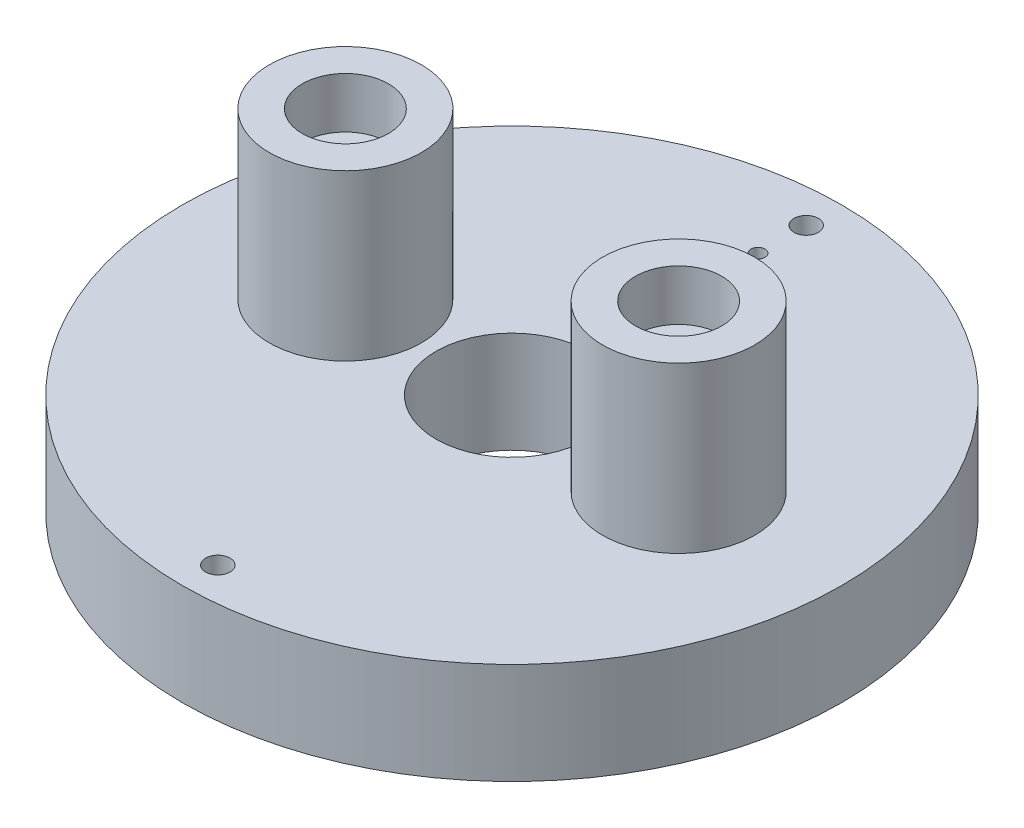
ISO-10303-21;
HEADER;
FILE_DESCRIPTION(('STEP AP214'),'2;1');
FILE_NAME('part.step','',(''),(''),'','','');
FILE_SCHEMA(('AUTOMOTIVE_DESIGN { 1 0 10303 214 1 1 1 1 }'));
ENDSEC;
DATA;
#1=APPLICATION_CONTEXT('core data for automotive mechanical design processes');
#2=APPLICATION_PROTOCOL_DEFINITION('international standard','automotive_design',2000,#1);
#3=PRODUCT_CONTEXT('',#1,'mechanical');
#4=PRODUCT('Part','Part','',(#3));
#5=PRODUCT_RELATED_PRODUCT_CATEGORY('part','',(#4));
#6=PRODUCT_DEFINITION_FORMATION('','',#4);
#7=PRODUCT_DEFINITION_CONTEXT('part definition',#1,'design');
#8=PRODUCT_DEFINITION('design','',#6,#7);
#9=PRODUCT_DEFINITION_SHAPE('','',#8);
#10=(LENGTH_UNIT() NAMED_UNIT(*) SI_UNIT(.MILLI.,.METRE.));
#11=(NAMED_UNIT(*) PLANE_ANGLE_UNIT() SI_UNIT($,.RADIAN.));
#12=(NAMED_UNIT(*) SI_UNIT($,.STERADIAN.) SOLID_ANGLE_UNIT());
#13=UNCERTAINTY_MEASURE_WITH_UNIT(LENGTH_MEASURE(1.E-05),#10,'distance_accuracy_value','');
#14=(GEOMETRIC_REPRESENTATION_CONTEXT(3) GLOBAL_UNCERTAINTY_ASSIGNED_CONTEXT((#13)) GLOBAL_UNIT_ASSIGNED_CONTEXT((#10,
#11,#12)) REPRESENTATION_CONTEXT('',''));
#15=CARTESIAN_POINT('',(0.,0.,0.));
#16=DIRECTION('',(0.,0.,1.));
#17=DIRECTION('',(1.,0.,0.));
#18=AXIS2_PLACEMENT_3D('',#15,#16,#17);
#19=CARTESIAN_POINT('',(0.,10.,0.));
#20=DIRECTION('',(0.,1.,0.));
#21=DIRECTION('',(0.,0.,1.));
#22=AXIS2_PLACEMENT_3D('',#19,#20,#21);
#23=PLANE('',#22);
#24=CARTESIAN_POINT('',(0.,10.,29.));
#25=DIRECTION('',(0.,1.,0.));
#26=DIRECTION('',(0.,0.,1.));
#27=AXIS2_PLACEMENT_3D('',#24,#25,#26);
#28=CIRCLE('',#27,1.2);
#29=CARTESIAN_POINT('',(0.,10.,30.2));
#30=VERTEX_POINT('',#29);
#31=EDGE_CURVE('E82',#30,#30,#28,.T.);
#32=ORIENTED_EDGE('',*,*,#31,.F.);
#33=EDGE_LOOP('',(#32));
#34=FACE_BOUND('',#33,.T.);
#35=CARTESIAN_POINT('',(0.,10.,-29.));
#36=DIRECTION('',(0.,1.,0.));
#37=DIRECTION('',(0.,0.,1.));
#38=AXIS2_PLACEMENT_3D('',#35,#36,#37);
#39=CIRCLE('',#38,1.2);
#40=CARTESIAN_POINT('',(0.,10.,-27.8));
#41=VERTEX_POINT('',#40);
#42=EDGE_CURVE('E68',#41,#41,#39,.T.);
#43=ORIENTED_EDGE('',*,*,#42,.F.);
#44=EDGE_LOOP('',(#43));
#45=FACE_BOUND('',#44,.T.);
#46=CARTESIAN_POINT('',(0.,10.,-24.25));
#47=DIRECTION('',(0.,-1.,0.));
#48=DIRECTION('',(0.,0.,-1.));
#49=AXIS2_PLACEMENT_3D('',#46,#47,#48);
#50=CIRCLE('',#49,0.7);
#51=CARTESIAN_POINT('',(0.,10.,-24.95));
#52=VERTEX_POINT('',#51);
#53=EDGE_CURVE('E64',#52,#52,#50,.T.);
#54=ORIENTED_EDGE('',*,*,#53,.T.);
#55=EDGE_LOOP('',(#54));
#56=FACE_BOUND('',#55,.T.);
#57=CARTESIAN_POINT('',(-16.425,10.,0.));
#58=DIRECTION('',(0.,1.,0.));
#59=DIRECTION('',(0.,0.,1.));
#60=AXIS2_PLACEMENT_3D('',#57,#58,#59);
#61=CIRCLE('',#60,7.5);
#62=CARTESIAN_POINT('',(-16.425,10.,-7.5));
#63=VERTEX_POINT('',#62);
#64=EDGE_CURVE('E61',#63,#63,#61,.T.);
#65=ORIENTED_EDGE('',*,*,#64,.F.);
#66=EDGE_LOOP('',(#65));
#67=FACE_BOUND('',#66,.T.);
#68=CARTESIAN_POINT('',(16.425,10.,0.));
#69=DIRECTION('',(0.,1.,0.));
#70=DIRECTION('',(0.,0.,1.));
#71=AXIS2_PLACEMENT_3D('',#68,#69,#70);
#72=CIRCLE('',#71,7.5);
#73=CARTESIAN_POINT('',(16.425,10.,-7.5));
#74=VERTEX_POINT('',#73);
#75=EDGE_CURVE('E56',#74,#74,#72,.T.);
#76=ORIENTED_EDGE('',*,*,#75,.F.);
#77=EDGE_LOOP('',(#76));
#78=FACE_BOUND('',#77,.T.);
#79=CARTESIAN_POINT('',(0.,10.,0.));
#80=DIRECTION('',(0.,1.,0.));
#81=DIRECTION('',(0.,0.,1.));
#82=AXIS2_PLACEMENT_3D('',#79,#80,#81);
#83=CIRCLE('',#82,32.5);
#84=CARTESIAN_POINT('',(0.,10.,32.5));
#85=VERTEX_POINT('',#84);
#86=EDGE_CURVE('E43',#85,#85,#83,.T.);
#87=ORIENTED_EDGE('',*,*,#86,.T.);
#88=EDGE_LOOP('',(#87));
#89=FACE_BOUND('',#88,.T.);
#90=CARTESIAN_POINT('',(0.,10.,0.));
#91=DIRECTION('',(0.,1.,0.));
#92=DIRECTION('',(0.,0.,1.));
#93=AXIS2_PLACEMENT_3D('',#90,#91,#92);
#94=CIRCLE('',#93,7.5);
#95=CARTESIAN_POINT('',(0.,10.,7.5));
#96=VERTEX_POINT('',#95);
#97=EDGE_CURVE('E51',#96,#96,#94,.T.);
#98=ORIENTED_EDGE('',*,*,#97,.F.);
#99=EDGE_LOOP('',(#98));
#100=FACE_BOUND('',#99,.T.);
#101=ADVANCED_FACE('F32',(#34,#45,#56,#67,#78,#89,#100),#23,.T.);
#102=CARTESIAN_POINT('',(0.,0.,0.));
#103=DIRECTION('',(0.,1.,0.));
#104=DIRECTION('',(0.,0.,1.));
#105=AXIS2_PLACEMENT_3D('',#102,#103,#104);
#106=PLANE('',#105);
#107=CARTESIAN_POINT('',(0.,0.,29.));
#108=DIRECTION('',(0.,-1.,0.));
#109=DIRECTION('',(0.,0.,-1.));
#110=AXIS2_PLACEMENT_3D('',#107,#108,#109);
#111=CIRCLE('',#110,2.19999999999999);
#112=CARTESIAN_POINT('',(0.,0.,26.8));
#113=VERTEX_POINT('',#112);
#114=EDGE_CURVE('E91',#113,#113,#111,.T.);
#115=ORIENTED_EDGE('',*,*,#114,.F.);
#116=EDGE_LOOP('',(#115));
#117=FACE_BOUND('',#116,.T.);
#118=CARTESIAN_POINT('',(0.,0.,-29.));
#119=DIRECTION('',(0.,-1.,0.));
#120=DIRECTION('',(0.,0.,-1.));
#121=AXIS2_PLACEMENT_3D('',#118,#119,#120);
#122=CIRCLE('',#121,2.19999999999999);
#123=CARTESIAN_POINT('',(0.,0.,-31.2));
#124=VERTEX_POINT('',#123);
#125=EDGE_CURVE('E79',#124,#124,#122,.T.);
#126=ORIENTED_EDGE('',*,*,#125,.F.);
#127=EDGE_LOOP('',(#126));
#128=FACE_BOUND('',#127,.T.);
#129=CARTESIAN_POINT('',(0.,0.,-24.25));
#130=DIRECTION('',(0.,-1.,0.));
#131=DIRECTION('',(0.,0.,-1.));
#132=AXIS2_PLACEMENT_3D('',#129,#130,#131);
#133=CIRCLE('',#132,0.7);
#134=CARTESIAN_POINT('',(0.,0.,-24.95));
#135=VERTEX_POINT('',#134);
#136=EDGE_CURVE('E65',#135,#135,#133,.T.);
#137=ORIENTED_EDGE('',*,*,#136,.F.);
#138=EDGE_LOOP('',(#137));
#139=FACE_BOUND('',#138,.T.);
#140=CARTESIAN_POINT('',(0.,0.,0.));
#141=DIRECTION('',(0.,1.,0.));
#142=DIRECTION('',(0.,0.,1.));
#143=AXIS2_PLACEMENT_3D('',#140,#141,#142);
#144=CIRCLE('',#143,32.5);
#145=CARTESIAN_POINT('',(0.,0.,32.5));
#146=VERTEX_POINT('',#145);
#147=EDGE_CURVE('E47',#146,#146,#144,.T.);
#148=ORIENTED_EDGE('',*,*,#147,.F.);
#149=EDGE_LOOP('',(#148));
#150=FACE_BOUND('',#149,.T.);
#151=CARTESIAN_POINT('',(0.,0.,0.));
#152=DIRECTION('',(0.,1.,0.));
#153=DIRECTION('',(0.,0.,1.));
#154=AXIS2_PLACEMENT_3D('',#151,#152,#153);
#155=CIRCLE('',#154,7.5);
#156=CARTESIAN_POINT('',(0.,0.,7.5));
#157=VERTEX_POINT('',#156);
#158=EDGE_CURVE('E53',#157,#157,#155,.T.);
#159=ORIENTED_EDGE('',*,*,#158,.T.);
#160=EDGE_LOOP('',(#159));
#161=FACE_BOUND('',#160,.T.);
#162=ADVANCED_FACE('F125',(#117,#128,#139,#150,#161),#106,.F.);
#163=CARTESIAN_POINT('',(0.,10.,0.));
#164=DIRECTION('',(0.,-1.,0.));
#165=DIRECTION('',(0.,0.,-1.));
#166=AXIS2_PLACEMENT_3D('',#163,#164,#165);
#167=CYLINDRICAL_SURFACE('',#166,32.5);
#168=ORIENTED_EDGE('',*,*,#86,.F.);
#169=EDGE_LOOP('',(#168));
#170=FACE_BOUND('',#169,.T.);
#171=ORIENTED_EDGE('',*,*,#147,.T.);
#172=EDGE_LOOP('',(#171));
#173=FACE_BOUND('',#172,.T.);
#174=ADVANCED_FACE('F34',(#170,#173),#167,.T.);
#175=CARTESIAN_POINT('',(0.,10.,0.));
#176=DIRECTION('',(0.,-1.,0.));
#177=DIRECTION('',(0.,0.,-1.));
#178=AXIS2_PLACEMENT_3D('',#175,#176,#177);
#179=CYLINDRICAL_SURFACE('',#178,7.5);
#180=ORIENTED_EDGE('',*,*,#97,.T.);
#181=EDGE_LOOP('',(#180));
#182=FACE_BOUND('',#181,.T.);
#183=ORIENTED_EDGE('',*,*,#158,.F.);
#184=EDGE_LOOP('',(#183));
#185=FACE_BOUND('',#184,.T.);
#186=ADVANCED_FACE('F135',(#182,#185),#179,.F.);
#187=CARTESIAN_POINT('',(16.425,21.25,0.));
#188=DIRECTION('',(0.,-1.,0.));
#189=DIRECTION('',(0.,0.,-1.));
#190=AXIS2_PLACEMENT_3D('',#187,#188,#189);
#191=CYLINDRICAL_SURFACE('',#190,7.5);
#192=CARTESIAN_POINT('',(16.425,26.25,0.));
#193=DIRECTION('',(0.,1.,0.));
#194=DIRECTION('',(0.,0.,1.));
#195=AXIS2_PLACEMENT_3D('',#192,#193,#194);
#196=CIRCLE('',#195,7.5);
#197=CARTESIAN_POINT('',(16.425,26.25,-7.5));
#198=VERTEX_POINT('',#197);
#199=EDGE_CURVE('E100',#198,#198,#196,.T.);
#200=CARTESIAN_POINT('',(16.425,10.,-7.5));
#201=CARTESIAN_POINT('',(16.425,10.1692708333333,-7.5));
#202=CARTESIAN_POINT('',(16.425,10.3385416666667,-7.5));
#203=CARTESIAN_POINT('',(16.425,10.6770833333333,-7.5));
#204=CARTESIAN_POINT('',(16.425,10.8463541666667,-7.5));
#205=CARTESIAN_POINT('',(16.425,11.1848958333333,-7.5));
#206=CARTESIAN_POINT('',(16.425,11.3541666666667,-7.5));
#207=CARTESIAN_POINT('',(16.425,11.6927083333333,-7.5));
#208=CARTESIAN_POINT('',(16.425,11.8619791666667,-7.5));
#209=CARTESIAN_POINT('',(16.425,12.2005208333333,-7.5));
#210=CARTESIAN_POINT('',(16.425,12.3697916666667,-7.5));
#211=CARTESIAN_POINT('',(16.425,12.7083333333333,-7.5));
#212=CARTESIAN_POINT('',(16.425,12.8776041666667,-7.5));
#213=CARTESIAN_POINT('',(16.425,13.2161458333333,-7.5));
#214=CARTESIAN_POINT('',(16.425,13.3854166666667,-7.5));
#215=CARTESIAN_POINT('',(16.425,13.7239583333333,-7.5));
#216=CARTESIAN_POINT('',(16.425,13.8932291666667,-7.5));
#217=CARTESIAN_POINT('',(16.425,14.2317708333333,-7.5));
#218=CARTESIAN_POINT('',(16.425,14.4010416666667,-7.5));
#219=CARTESIAN_POINT('',(16.425,14.7395833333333,-7.5));
#220=CARTESIAN_POINT('',(16.425,14.9088541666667,-7.5));
#221=CARTESIAN_POINT('',(16.425,15.2473958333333,-7.5));
#222=CARTESIAN_POINT('',(16.425,15.4166666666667,-7.5));
#223=CARTESIAN_POINT('',(16.425,15.7552083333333,-7.5));
#224=CARTESIAN_POINT('',(16.425,15.9244791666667,-7.5));
#225=CARTESIAN_POINT('',(16.425,16.2630208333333,-7.5));
#226=CARTESIAN_POINT('',(16.425,16.4322916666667,-7.5));
#227=CARTESIAN_POINT('',(16.425,16.7708333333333,-7.5));
#228=CARTESIAN_POINT('',(16.425,16.9401041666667,-7.5));
#229=CARTESIAN_POINT('',(16.425,17.2786458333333,-7.5));
#230=CARTESIAN_POINT('',(16.425,17.4479166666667,-7.5));
#231=CARTESIAN_POINT('',(16.425,17.7864583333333,-7.5));
#232=CARTESIAN_POINT('',(16.425,17.9557291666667,-7.5));
#233=CARTESIAN_POINT('',(16.425,18.2942708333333,-7.5));
#234=CARTESIAN_POINT('',(16.425,18.4635416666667,-7.5));
#235=CARTESIAN_POINT('',(16.425,18.8020833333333,-7.5));
#236=CARTESIAN_POINT('',(16.425,18.9713541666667,-7.5));
#237=CARTESIAN_POINT('',(16.425,19.3098958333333,-7.5));
#238=CARTESIAN_POINT('',(16.425,19.4791666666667,-7.5));
#239=CARTESIAN_POINT('',(16.425,19.8177083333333,-7.5));
#240=CARTESIAN_POINT('',(16.425,19.9869791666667,-7.5));
#241=CARTESIAN_POINT('',(16.425,20.3255208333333,-7.5));
#242=CARTESIAN_POINT('',(16.425,20.4947916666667,-7.5));
#243=CARTESIAN_POINT('',(16.425,20.8333333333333,-7.5));
#244=CARTESIAN_POINT('',(16.425,21.0026041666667,-7.5));
#245=CARTESIAN_POINT('',(16.425,21.3411458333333,-7.5));
#246=CARTESIAN_POINT('',(16.425,21.5104166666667,-7.5));
#247=CARTESIAN_POINT('',(16.425,21.8489583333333,-7.5));
#248=CARTESIAN_POINT('',(16.425,22.0182291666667,-7.5));
#249=CARTESIAN_POINT('',(16.425,22.3567708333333,-7.5));
#250=CARTESIAN_POINT('',(16.425,22.5260416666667,-7.5));
#251=CARTESIAN_POINT('',(16.425,22.8645833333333,-7.5));
#252=CARTESIAN_POINT('',(16.425,23.0338541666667,-7.5));
#253=CARTESIAN_POINT('',(16.425,23.3723958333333,-7.5));
#254=CARTESIAN_POINT('',(16.425,23.5416666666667,-7.5));
#255=CARTESIAN_POINT('',(16.425,23.8802083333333,-7.5));
#256=CARTESIAN_POINT('',(16.425,24.0494791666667,-7.5));
#257=CARTESIAN_POINT('',(16.425,24.3880208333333,-7.5));
#258=CARTESIAN_POINT('',(16.425,24.5572916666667,-7.5));
#259=CARTESIAN_POINT('',(16.425,24.8958333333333,-7.5));
#260=CARTESIAN_POINT('',(16.425,25.0651041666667,-7.5));
#261=CARTESIAN_POINT('',(16.425,25.4036458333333,-7.5));
#262=CARTESIAN_POINT('',(16.425,25.5729166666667,-7.5));
#263=CARTESIAN_POINT('',(16.425,25.9114583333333,-7.5));
#264=CARTESIAN_POINT('',(16.425,26.0807291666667,-7.5));
#265=CARTESIAN_POINT('',(16.425,26.25,-7.5));
#266=B_SPLINE_CURVE_WITH_KNOTS('',3,(#200,#201,#202,#203,#204,#205,#206,#207,#208,#209,#210,
#211,#212,#213,#214,#215,#216,#217,#218,#219,#220,#221,#222,#223,#224,#225,#226,#227,#228,#229,
#230,#231,#232,#233,#234,#235,#236,#237,#238,#239,#240,#241,#242,#243,#244,#245,#246,#247,#248,
#249,#250,#251,#252,#253,#254,#255,#256,#257,#258,#259,#260,#261,#262,#263,#264,#265),
.UNSPECIFIED.,.F.,.F.,(4,2,2,2,2,2,2,2,2,2,2,2,2,2,2,2,2,2,2,2,2,2,2,2,2,2,2,2,2,2,2,2,4),(0.,
0.5078125,1.015625,1.5234375,2.03125,2.5390625,3.046875,3.5546875,4.0625,4.5703125,5.078125,
5.5859375,6.09375,6.6015625,7.109375,7.6171875,8.125,8.6328125,9.140625,9.6484375,10.15625,
10.6640625,11.171875,11.6796875,12.1875,12.6953125,13.203125,13.7109375,14.21875,14.7265625,
15.234375,15.7421875,16.25),.UNSPECIFIED.);
#267=EDGE_CURVE('BSEAM138',#74,#198,#266,.T.);
#268=ORIENTED_EDGE('',*,*,#75,.T.);
#269=ORIENTED_EDGE('',*,*,#199,.F.);
#270=ORIENTED_EDGE('',*,*,#267,.T.);
#271=ORIENTED_EDGE('',*,*,#267,.F.);
#272=EDGE_LOOP('',(#268,#270,#269,#271));
#273=FACE_BOUND('',#272,.T.);
#274=ADVANCED_FACE('F138',(#273),#191,.T.);
#275=CARTESIAN_POINT('',(-16.425,21.25,0.));
#276=DIRECTION('',(0.,-1.,0.));
#277=DIRECTION('',(0.,0.,-1.));
#278=AXIS2_PLACEMENT_3D('',#275,#276,#277);
#279=CYLINDRICAL_SURFACE('',#278,7.5);
#280=CARTESIAN_POINT('',(-16.425,26.25,0.));
#281=DIRECTION('',(0.,1.,0.));
#282=DIRECTION('',(0.,0.,1.));
#283=AXIS2_PLACEMENT_3D('',#280,#281,#282);
#284=CIRCLE('',#283,7.5);
#285=CARTESIAN_POINT('',(-16.425,26.25,-7.5));
#286=VERTEX_POINT('',#285);
#287=EDGE_CURVE('E94',#286,#286,#284,.T.);
#288=CARTESIAN_POINT('',(-16.425,10.,-7.5));
#289=CARTESIAN_POINT('',(-16.425,10.1692708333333,-7.5));
#290=CARTESIAN_POINT('',(-16.425,10.3385416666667,-7.5));
#291=CARTESIAN_POINT('',(-16.425,10.6770833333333,-7.5));
#292=CARTESIAN_POINT('',(-16.425,10.8463541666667,-7.5));
#293=CARTESIAN_POINT('',(-16.425,11.1848958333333,-7.5));
#294=CARTESIAN_POINT('',(-16.425,11.3541666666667,-7.5));
#295=CARTESIAN_POINT('',(-16.425,11.6927083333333,-7.5));
#296=CARTESIAN_POINT('',(-16.425,11.8619791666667,-7.5));
#297=CARTESIAN_POINT('',(-16.425,12.2005208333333,-7.5));
#298=CARTESIAN_POINT('',(-16.425,12.3697916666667,-7.5));
#299=CARTESIAN_POINT('',(-16.425,12.7083333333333,-7.5));
#300=CARTESIAN_POINT('',(-16.425,12.8776041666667,-7.5));
#301=CARTESIAN_POINT('',(-16.425,13.2161458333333,-7.5));
#302=CARTESIAN_POINT('',(-16.425,13.3854166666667,-7.5));
#303=CARTESIAN_POINT('',(-16.425,13.7239583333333,-7.5));
#304=CARTESIAN_POINT('',(-16.425,13.8932291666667,-7.5));
#305=CARTESIAN_POINT('',(-16.425,14.2317708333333,-7.5));
#306=CARTESIAN_POINT('',(-16.425,14.4010416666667,-7.5));
#307=CARTESIAN_POINT('',(-16.425,14.7395833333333,-7.5));
#308=CARTESIAN_POINT('',(-16.425,14.9088541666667,-7.5));
#309=CARTESIAN_POINT('',(-16.425,15.2473958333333,-7.5));
#310=CARTESIAN_POINT('',(-16.425,15.4166666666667,-7.5));
#311=CARTESIAN_POINT('',(-16.425,15.7552083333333,-7.5));
#312=CARTESIAN_POINT('',(-16.425,15.9244791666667,-7.5));
#313=CARTESIAN_POINT('',(-16.425,16.2630208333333,-7.5));
#314=CARTESIAN_POINT('',(-16.425,16.4322916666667,-7.5));
#315=CARTESIAN_POINT('',(-16.425,16.7708333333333,-7.5));
#316=CARTESIAN_POINT('',(-16.425,16.9401041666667,-7.5));
#317=CARTESIAN_POINT('',(-16.425,17.2786458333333,-7.5));
#318=CARTESIAN_POINT('',(-16.425,17.4479166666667,-7.5));
#319=CARTESIAN_POINT('',(-16.425,17.7864583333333,-7.5));
#320=CARTESIAN_POINT('',(-16.425,17.9557291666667,-7.5));
#321=CARTESIAN_POINT('',(-16.425,18.2942708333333,-7.5));
#322=CARTESIAN_POINT('',(-16.425,18.4635416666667,-7.5));
#323=CARTESIAN_POINT('',(-16.425,18.8020833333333,-7.5));
#324=CARTESIAN_POINT('',(-16.425,18.9713541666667,-7.5));
#325=CARTESIAN_POINT('',(-16.425,19.3098958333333,-7.5));
#326=CARTESIAN_POINT('',(-16.425,19.4791666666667,-7.5));
#327=CARTESIAN_POINT('',(-16.425,19.8177083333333,-7.5));
#328=CARTESIAN_POINT('',(-16.425,19.9869791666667,-7.5));
#329=CARTESIAN_POINT('',(-16.425,20.3255208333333,-7.5));
#330=CARTESIAN_POINT('',(-16.425,20.4947916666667,-7.5));
#331=CARTESIAN_POINT('',(-16.425,20.8333333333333,-7.5));
#332=CARTESIAN_POINT('',(-16.425,21.0026041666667,-7.5));
#333=CARTESIAN_POINT('',(-16.425,21.3411458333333,-7.5));
#334=CARTESIAN_POINT('',(-16.425,21.5104166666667,-7.5));
#335=CARTESIAN_POINT('',(-16.425,21.8489583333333,-7.5));
#336=CARTESIAN_POINT('',(-16.425,22.0182291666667,-7.5));
#337=CARTESIAN_POINT('',(-16.425,22.3567708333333,-7.5));
#338=CARTESIAN_POINT('',(-16.425,22.5260416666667,-7.5));
#339=CARTESIAN_POINT('',(-16.425,22.8645833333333,-7.5));
#340=CARTESIAN_POINT('',(-16.425,23.0338541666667,-7.5));
#341=CARTESIAN_POINT('',(-16.425,23.3723958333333,-7.5));
#342=CARTESIAN_POINT('',(-16.425,23.5416666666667,-7.5));
#343=CARTESIAN_POINT('',(-16.425,23.8802083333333,-7.5));
#344=CARTESIAN_POINT('',(-16.425,24.0494791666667,-7.5));
#345=CARTESIAN_POINT('',(-16.425,24.3880208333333,-7.5));
#346=CARTESIAN_POINT('',(-16.425,24.5572916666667,-7.5));
#347=CARTESIAN_POINT('',(-16.425,24.8958333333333,-7.5));
#348=CARTESIAN_POINT('',(-16.425,25.0651041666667,-7.5));
#349=CARTESIAN_POINT('',(-16.425,25.4036458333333,-7.5));
#350=CARTESIAN_POINT('',(-16.425,25.5729166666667,-7.5));
#351=CARTESIAN_POINT('',(-16.425,25.9114583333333,-7.5));
#352=CARTESIAN_POINT('',(-16.425,26.0807291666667,-7.5));
#353=CARTESIAN_POINT('',(-16.425,26.25,-7.5));
#354=B_SPLINE_CURVE_WITH_KNOTS('',3,(#288,#289,#290,#291,#292,#293,#294,#295,#296,#297,#298,
#299,#300,#301,#302,#303,#304,#305,#306,#307,#308,#309,#310,#311,#312,#313,#314,#315,#316,#317,
#318,#319,#320,#321,#322,#323,#324,#325,#326,#327,#328,#329,#330,#331,#332,#333,#334,#335,#336,
#337,#338,#339,#340,#341,#342,#343,#344,#345,#346,#347,#348,#349,#350,#351,#352,#353),
.UNSPECIFIED.,.F.,.F.,(4,2,2,2,2,2,2,2,2,2,2,2,2,2,2,2,2,2,2,2,2,2,2,2,2,2,2,2,2,2,2,2,4),(0.,
0.5078125,1.015625,1.5234375,2.03125,2.5390625,3.046875,3.5546875,4.0625,4.5703125,5.078125,
5.5859375,6.09375,6.6015625,7.109375,7.6171875,8.125,8.6328125,9.140625,9.6484375,10.15625,
10.6640625,11.171875,11.6796875,12.1875,12.6953125,13.203125,13.7109375,14.21875,14.7265625,
15.234375,15.7421875,16.25),.UNSPECIFIED.);
#355=EDGE_CURVE('BSEAM142',#63,#286,#354,.T.);
#356=ORIENTED_EDGE('',*,*,#64,.T.);
#357=ORIENTED_EDGE('',*,*,#287,.F.);
#358=ORIENTED_EDGE('',*,*,#355,.T.);
#359=ORIENTED_EDGE('',*,*,#355,.F.);
#360=EDGE_LOOP('',(#356,#358,#357,#359));
#361=FACE_BOUND('',#360,.T.);
#362=ADVANCED_FACE('F142',(#361),#279,.T.);
#363=CARTESIAN_POINT('',(0.,10.,-24.25));
#364=DIRECTION('',(0.,-1.,0.));
#365=DIRECTION('',(0.,0.,-1.));
#366=AXIS2_PLACEMENT_3D('',#363,#364,#365);
#367=CYLINDRICAL_SURFACE('',#366,0.7);
#368=ORIENTED_EDGE('',*,*,#53,.F.);
#369=EDGE_LOOP('',(#368));
#370=FACE_BOUND('',#369,.T.);
#371=ORIENTED_EDGE('',*,*,#136,.T.);
#372=EDGE_LOOP('',(#371));
#373=FACE_BOUND('',#372,.T.);
#374=ADVANCED_FACE('F148',(#370,#373),#367,.F.);
#375=CARTESIAN_POINT('',(0.,0.,-29.));
#376=DIRECTION('',(0.,-1.,0.));
#377=DIRECTION('',(0.,0.,-1.));
#378=AXIS2_PLACEMENT_3D('',#375,#376,#377);
#379=CYLINDRICAL_SURFACE('',#378,1.2);
#380=CARTESIAN_POINT('',(0.,8.,-29.));
#381=DIRECTION('',(0.,-1.,0.));
#382=DIRECTION('',(0.,0.,-1.));
#383=AXIS2_PLACEMENT_3D('',#380,#381,#382);
#384=CIRCLE('',#383,1.2);
#385=CARTESIAN_POINT('',(0.,8.,-30.2));
#386=VERTEX_POINT('',#385);
#387=EDGE_CURVE('E73',#386,#386,#384,.T.);
#388=ORIENTED_EDGE('',*,*,#387,.T.);
#389=EDGE_LOOP('',(#388));
#390=FACE_BOUND('',#389,.T.);
#391=ORIENTED_EDGE('',*,*,#42,.T.);
#392=EDGE_LOOP('',(#391));
#393=FACE_BOUND('',#392,.T.);
#394=ADVANCED_FACE('F153',(#390,#393),#379,.F.);
#395=CARTESIAN_POINT('',(1.2,8.,-29.));
#396=DIRECTION('',(0.,1.,0.));
#397=DIRECTION('',(0.,0.,1.));
#398=AXIS2_PLACEMENT_3D('',#395,#396,#397);
#399=PLANE('',#398);
#400=ORIENTED_EDGE('',*,*,#387,.F.);
#401=EDGE_LOOP('',(#400));
#402=FACE_BOUND('',#401,.T.);
#403=CARTESIAN_POINT('',(0.,8.,-29.));
#404=DIRECTION('',(0.,-1.,0.));
#405=DIRECTION('',(0.,0.,-1.));
#406=AXIS2_PLACEMENT_3D('',#403,#404,#405);
#407=CIRCLE('',#406,2.2);
#408=CARTESIAN_POINT('',(0.,8.,-31.2));
#409=VERTEX_POINT('',#408);
#410=EDGE_CURVE('E76',#409,#409,#407,.T.);
#411=ORIENTED_EDGE('',*,*,#410,.T.);
#412=EDGE_LOOP('',(#411));
#413=FACE_BOUND('',#412,.T.);
#414=ADVANCED_FACE('F157',(#402,#413),#399,.F.);
#415=CARTESIAN_POINT('',(0.,0.,-29.));
#416=DIRECTION('',(0.,-1.,0.));
#417=DIRECTION('',(0.,0.,-1.));
#418=AXIS2_PLACEMENT_3D('',#415,#416,#417);
#419=CYLINDRICAL_SURFACE('',#418,2.19999999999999);
#420=ORIENTED_EDGE('',*,*,#410,.F.);
#421=EDGE_LOOP('',(#420));
#422=FACE_BOUND('',#421,.T.);
#423=ORIENTED_EDGE('',*,*,#125,.T.);
#424=EDGE_LOOP('',(#423));
#425=FACE_BOUND('',#424,.T.);
#426=ADVANCED_FACE('F161',(#422,#425),#419,.F.);
#427=CARTESIAN_POINT('',(0.,0.,29.));
#428=DIRECTION('',(0.,-1.,0.));
#429=DIRECTION('',(0.,0.,-1.));
#430=AXIS2_PLACEMENT_3D('',#427,#428,#429);
#431=CYLINDRICAL_SURFACE('',#430,1.2);
#432=CARTESIAN_POINT('',(0.,8.,29.));
#433=DIRECTION('',(0.,-1.,0.));
#434=DIRECTION('',(0.,0.,-1.));
#435=AXIS2_PLACEMENT_3D('',#432,#433,#434);
#436=CIRCLE('',#435,1.2);
#437=CARTESIAN_POINT('',(0.,8.,27.8));
#438=VERTEX_POINT('',#437);
#439=EDGE_CURVE('E85',#438,#438,#436,.T.);
#440=ORIENTED_EDGE('',*,*,#439,.T.);
#441=EDGE_LOOP('',(#440));
#442=FACE_BOUND('',#441,.T.);
#443=ORIENTED_EDGE('',*,*,#31,.T.);
#444=EDGE_LOOP('',(#443));
#445=FACE_BOUND('',#444,.T.);
#446=ADVANCED_FACE('F165',(#442,#445),#431,.F.);
#447=CARTESIAN_POINT('',(1.2,8.,29.));
#448=DIRECTION('',(0.,1.,0.));
#449=DIRECTION('',(0.,0.,1.));
#450=AXIS2_PLACEMENT_3D('',#447,#448,#449);
#451=PLANE('',#450);
#452=ORIENTED_EDGE('',*,*,#439,.F.);
#453=EDGE_LOOP('',(#452));
#454=FACE_BOUND('',#453,.T.);
#455=CARTESIAN_POINT('',(0.,8.,29.));
#456=DIRECTION('',(0.,-1.,0.));
#457=DIRECTION('',(0.,0.,-1.));
#458=AXIS2_PLACEMENT_3D('',#455,#456,#457);
#459=CIRCLE('',#458,2.2);
#460=CARTESIAN_POINT('',(0.,8.,26.8));
#461=VERTEX_POINT('',#460);
#462=EDGE_CURVE('E88',#461,#461,#459,.T.);
#463=ORIENTED_EDGE('',*,*,#462,.T.);
#464=EDGE_LOOP('',(#463));
#465=FACE_BOUND('',#464,.T.);
#466=ADVANCED_FACE('F169',(#454,#465),#451,.F.);
#467=CARTESIAN_POINT('',(0.,0.,29.));
#468=DIRECTION('',(0.,-1.,0.));
#469=DIRECTION('',(0.,0.,-1.));
#470=AXIS2_PLACEMENT_3D('',#467,#468,#469);
#471=CYLINDRICAL_SURFACE('',#470,2.19999999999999);
#472=ORIENTED_EDGE('',*,*,#462,.F.);
#473=EDGE_LOOP('',(#472));
#474=FACE_BOUND('',#473,.T.);
#475=ORIENTED_EDGE('',*,*,#114,.T.);
#476=EDGE_LOOP('',(#475));
#477=FACE_BOUND('',#476,.T.);
#478=ADVANCED_FACE('F173',(#474,#477),#471,.F.);
#479=CARTESIAN_POINT('',(-16.425,26.25,0.));
#480=DIRECTION('',(0.,1.,0.));
#481=DIRECTION('',(0.,0.,1.));
#482=AXIS2_PLACEMENT_3D('',#479,#480,#481);
#483=PLANE('',#482);
#484=ORIENTED_EDGE('',*,*,#287,.T.);
#485=EDGE_LOOP('',(#484));
#486=FACE_BOUND('',#485,.T.);
#487=CARTESIAN_POINT('',(-16.425,26.25,0.));
#488=DIRECTION('',(0.,1.,0.));
#489=DIRECTION('',(0.,0.,1.));
#490=AXIS2_PLACEMENT_3D('',#487,#488,#489);
#491=CIRCLE('',#490,4.25);
#492=CARTESIAN_POINT('',(-16.425,26.25,4.25));
#493=VERTEX_POINT('',#492);
#494=EDGE_CURVE('E97',#493,#493,#491,.T.);
#495=ORIENTED_EDGE('',*,*,#494,.F.);
#496=EDGE_LOOP('',(#495));
#497=FACE_BOUND('',#496,.T.);
#498=ADVANCED_FACE('F177',(#486,#497),#483,.T.);
#499=CARTESIAN_POINT('',(-16.425,26.25,0.));
#500=DIRECTION('',(0.,-1.,0.));
#501=DIRECTION('',(0.,0.,-1.));
#502=AXIS2_PLACEMENT_3D('',#499,#500,#501);
#503=CYLINDRICAL_SURFACE('',#502,4.25);
#504=ORIENTED_EDGE('',*,*,#494,.T.);
#505=EDGE_LOOP('',(#504));
#506=FACE_BOUND('',#505,.T.);
#507=CARTESIAN_POINT('',(-16.425,21.25,0.));
#508=DIRECTION('',(0.,1.,0.));
#509=DIRECTION('',(0.,0.,1.));
#510=AXIS2_PLACEMENT_3D('',#507,#508,#509);
#511=CIRCLE('',#510,4.25);
#512=CARTESIAN_POINT('',(-16.425,21.25,4.25));
#513=VERTEX_POINT('',#512);
#514=EDGE_CURVE('E39',#513,#513,#511,.F.);
#515=ORIENTED_EDGE('',*,*,#514,.T.);
#516=EDGE_LOOP('',(#515));
#517=FACE_BOUND('',#516,.T.);
#518=ADVANCED_FACE('F120',(#506,#517),#503,.F.);
#519=CARTESIAN_POINT('',(-16.425,21.25,0.));
#520=DIRECTION('',(0.,1.,0.));
#521=DIRECTION('',(0.,0.,1.));
#522=AXIS2_PLACEMENT_3D('',#519,#520,#521);
#523=PLANE('',#522);
#524=ORIENTED_EDGE('',*,*,#514,.F.);
#525=EDGE_LOOP('',(#524));
#526=FACE_BOUND('',#525,.T.);
#527=ADVANCED_FACE('F111',(#526),#523,.T.);
#528=CARTESIAN_POINT('',(16.425,26.25,0.));
#529=DIRECTION('',(0.,1.,0.));
#530=DIRECTION('',(0.,0.,1.));
#531=AXIS2_PLACEMENT_3D('',#528,#529,#530);
#532=PLANE('',#531);
#533=ORIENTED_EDGE('',*,*,#199,.T.);
#534=EDGE_LOOP('',(#533));
#535=FACE_BOUND('',#534,.T.);
#536=CARTESIAN_POINT('',(16.425,26.25,0.));
#537=DIRECTION('',(0.,1.,0.));
#538=DIRECTION('',(0.,0.,1.));
#539=AXIS2_PLACEMENT_3D('',#536,#537,#538);
#540=CIRCLE('',#539,4.25);
#541=CARTESIAN_POINT('',(16.425,26.25,4.25));
#542=VERTEX_POINT('',#541);
#543=EDGE_CURVE('E103',#542,#542,#540,.T.);
#544=ORIENTED_EDGE('',*,*,#543,.F.);
#545=EDGE_LOOP('',(#544));
#546=FACE_BOUND('',#545,.T.);
#547=ADVANCED_FACE('F109',(#535,#546),#532,.T.);
#548=CARTESIAN_POINT('',(16.425,26.25,0.));
#549=DIRECTION('',(0.,-1.,0.));
#550=DIRECTION('',(0.,0.,-1.));
#551=AXIS2_PLACEMENT_3D('',#548,#549,#550);
#552=CYLINDRICAL_SURFACE('',#551,4.25);
#553=ORIENTED_EDGE('',*,*,#543,.T.);
#554=EDGE_LOOP('',(#553));
#555=FACE_BOUND('',#554,.T.);
#556=CARTESIAN_POINT('',(16.425,21.25,0.));
#557=DIRECTION('',(0.,1.,0.));
#558=DIRECTION('',(0.,0.,1.));
#559=AXIS2_PLACEMENT_3D('',#556,#557,#558);
#560=CIRCLE('',#559,4.25);
#561=CARTESIAN_POINT('',(16.425,21.25,4.25));
#562=VERTEX_POINT('',#561);
#563=EDGE_CURVE('E10',#562,#562,#560,.F.);
#564=ORIENTED_EDGE('',*,*,#563,.T.);
#565=EDGE_LOOP('',(#564));
#566=FACE_BOUND('',#565,.T.);
#567=ADVANCED_FACE('F107',(#555,#566),#552,.F.);
#568=CARTESIAN_POINT('',(16.425,21.25,0.));
#569=DIRECTION('',(0.,1.,0.));
#570=DIRECTION('',(0.,0.,1.));
#571=AXIS2_PLACEMENT_3D('',#568,#569,#570);
#572=PLANE('',#571);
#573=ORIENTED_EDGE('',*,*,#563,.F.);
#574=EDGE_LOOP('',(#573));
#575=FACE_BOUND('',#574,.T.);
#576=ADVANCED_FACE('F118',(#575),#572,.T.);
#577=CLOSED_SHELL('',(#101,#162,#174,#186,#274,#362,#374,#394,#414,#426,#446,#466,#478,#498,
#518,#527,#547,#567,#576));
#578=MANIFOLD_SOLID_BREP('B2',#577);
#579=ADVANCED_BREP_SHAPE_REPRESENTATION('',(#18,#578),#14);
#580=SHAPE_DEFINITION_REPRESENTATION(#9,#579);
ENDSEC;
END-ISO-10303-21;
